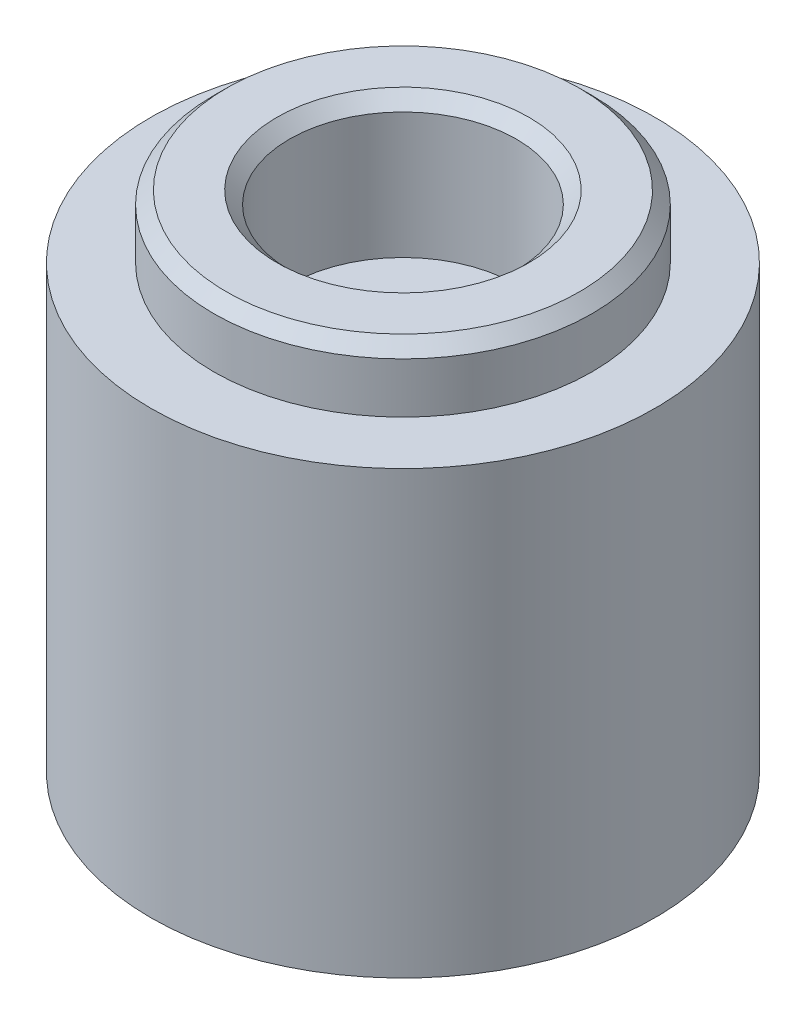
ISO-10303-21;
HEADER;
FILE_DESCRIPTION(('STEP AP214'),'2;1');
FILE_NAME('part.step','',(''),(''),'','','');
FILE_SCHEMA(('AUTOMOTIVE_DESIGN { 1 0 10303 214 1 1 1 1 }'));
ENDSEC;
DATA;
#1=APPLICATION_CONTEXT('core data for automotive mechanical design processes');
#2=APPLICATION_PROTOCOL_DEFINITION('international standard','automotive_design',2000,#1);
#3=PRODUCT_CONTEXT('',#1,'mechanical');
#4=PRODUCT('Part','Part','',(#3));
#5=PRODUCT_RELATED_PRODUCT_CATEGORY('part','',(#4));
#6=PRODUCT_DEFINITION_FORMATION('','',#4);
#7=PRODUCT_DEFINITION_CONTEXT('part definition',#1,'design');
#8=PRODUCT_DEFINITION('design','',#6,#7);
#9=PRODUCT_DEFINITION_SHAPE('','',#8);
#10=(LENGTH_UNIT() NAMED_UNIT(*) SI_UNIT(.MILLI.,.METRE.));
#11=(NAMED_UNIT(*) PLANE_ANGLE_UNIT() SI_UNIT($,.RADIAN.));
#12=(NAMED_UNIT(*) SI_UNIT($,.STERADIAN.) SOLID_ANGLE_UNIT());
#13=UNCERTAINTY_MEASURE_WITH_UNIT(LENGTH_MEASURE(1.E-05),#10,'distance_accuracy_value','');
#14=(GEOMETRIC_REPRESENTATION_CONTEXT(3) GLOBAL_UNCERTAINTY_ASSIGNED_CONTEXT((#13)) GLOBAL_UNIT_ASSIGNED_CONTEXT((#10,
#11,#12)) REPRESENTATION_CONTEXT('',''));
#15=CARTESIAN_POINT('',(0.,0.,0.));
#16=DIRECTION('',(0.,0.,1.));
#17=DIRECTION('',(1.,0.,0.));
#18=AXIS2_PLACEMENT_3D('',#15,#16,#17);
#19=CARTESIAN_POINT('',(9.,0.,0.));
#20=DIRECTION('',(0.,1.,0.));
#21=DIRECTION('',(0.,0.,1.));
#22=AXIS2_PLACEMENT_3D('',#19,#20,#21);
#23=PLANE('',#22);
#24=CARTESIAN_POINT('',(0.,0.,0.));
#25=DIRECTION('',(0.,1.,0.));
#26=DIRECTION('',(0.,0.,1.));
#27=AXIS2_PLACEMENT_3D('',#24,#25,#26);
#28=CIRCLE('',#27,6.50000000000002);
#29=CARTESIAN_POINT('',(0.,0.,6.50000000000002));
#30=VERTEX_POINT('',#29);
#31=EDGE_CURVE('E52',#30,#30,#28,.T.);
#32=ORIENTED_EDGE('',*,*,#31,.T.);
#33=EDGE_LOOP('',(#32));
#34=FACE_BOUND('',#33,.T.);
#35=CARTESIAN_POINT('',(0.,0.,0.));
#36=DIRECTION('',(0.,1.,0.));
#37=DIRECTION('',(0.,0.,1.));
#38=AXIS2_PLACEMENT_3D('',#35,#36,#37);
#39=CIRCLE('',#38,7.99999999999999);
#40=CARTESIAN_POINT('',(0.,0.,7.99999999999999));
#41=VERTEX_POINT('',#40);
#42=EDGE_CURVE('E55',#41,#41,#39,.F.);
#43=ORIENTED_EDGE('',*,*,#42,.T.);
#44=EDGE_LOOP('',(#43));
#45=FACE_BOUND('',#44,.T.);
#46=ADVANCED_FACE('F27',(#34,#45),#23,.F.);
#47=CARTESIAN_POINT('',(0.,30.,0.));
#48=DIRECTION('',(0.,1.,0.));
#49=DIRECTION('',(0.,0.,1.));
#50=AXIS2_PLACEMENT_3D('',#47,#48,#49);
#51=CYLINDRICAL_SURFACE('',#50,9.);
#52=CARTESIAN_POINT('',(0.,1.00000000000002,0.));
#53=DIRECTION('',(0.,1.,0.));
#54=DIRECTION('',(0.,0.,1.));
#55=AXIS2_PLACEMENT_3D('',#52,#53,#54);
#56=CIRCLE('',#55,9.);
#57=CARTESIAN_POINT('',(0.,1.00000000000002,9.));
#58=VERTEX_POINT('',#57);
#59=EDGE_CURVE('E46',#58,#58,#56,.T.);
#60=ORIENTED_EDGE('',*,*,#59,.T.);
#61=EDGE_LOOP('',(#60));
#62=FACE_BOUND('',#61,.T.);
#63=CARTESIAN_POINT('',(0.,6.,0.));
#64=DIRECTION('',(0.,1.,0.));
#65=DIRECTION('',(0.,0.,1.));
#66=AXIS2_PLACEMENT_3D('',#63,#64,#65);
#67=CIRCLE('',#66,9.);
#68=CARTESIAN_POINT('',(0.,6.,9.));
#69=VERTEX_POINT('',#68);
#70=EDGE_CURVE('E58',#69,#69,#67,.T.);
#71=ORIENTED_EDGE('',*,*,#70,.F.);
#72=EDGE_LOOP('',(#71));
#73=FACE_BOUND('',#72,.T.);
#74=ADVANCED_FACE('F96',(#62,#73),#51,.T.);
#75=CARTESIAN_POINT('',(20.,6.,0.));
#76=DIRECTION('',(0.,1.,0.));
#77=DIRECTION('',(0.,0.,1.));
#78=AXIS2_PLACEMENT_3D('',#75,#76,#77);
#79=PLANE('',#78);
#80=CARTESIAN_POINT('',(0.,6.,0.));
#81=DIRECTION('',(0.,1.,0.));
#82=DIRECTION('',(0.,0.,1.));
#83=AXIS2_PLACEMENT_3D('',#80,#81,#82);
#84=CIRCLE('',#83,20.);
#85=CARTESIAN_POINT('',(0.,6.,20.));
#86=VERTEX_POINT('',#85);
#87=EDGE_CURVE('E61',#86,#86,#84,.T.);
#88=ORIENTED_EDGE('',*,*,#87,.F.);
#89=EDGE_LOOP('',(#88));
#90=FACE_BOUND('',#89,.T.);
#91=ORIENTED_EDGE('',*,*,#70,.T.);
#92=EDGE_LOOP('',(#91));
#93=FACE_BOUND('',#92,.T.);
#94=ADVANCED_FACE('F101',(#90,#93),#79,.F.);
#95=CARTESIAN_POINT('',(0.,30.,0.));
#96=DIRECTION('',(0.,1.,0.));
#97=DIRECTION('',(0.,0.,1.));
#98=AXIS2_PLACEMENT_3D('',#95,#96,#97);
#99=CYLINDRICAL_SURFACE('',#98,20.);
#100=CARTESIAN_POINT('',(0.,41.,0.));
#101=DIRECTION('',(0.,1.,0.));
#102=DIRECTION('',(0.,0.,1.));
#103=AXIS2_PLACEMENT_3D('',#100,#101,#102);
#104=CIRCLE('',#103,20.);
#105=CARTESIAN_POINT('',(0.,41.,20.));
#106=VERTEX_POINT('',#105);
#107=EDGE_CURVE('E64',#106,#106,#104,.T.);
#108=ORIENTED_EDGE('',*,*,#107,.F.);
#109=EDGE_LOOP('',(#108));
#110=FACE_BOUND('',#109,.T.);
#111=ORIENTED_EDGE('',*,*,#87,.T.);
#112=EDGE_LOOP('',(#111));
#113=FACE_BOUND('',#112,.T.);
#114=ADVANCED_FACE('F118',(#110,#113),#99,.T.);
#115=CARTESIAN_POINT('',(15.,41.,0.));
#116=DIRECTION('',(0.,-1.,0.));
#117=DIRECTION('',(0.,0.,-1.));
#118=AXIS2_PLACEMENT_3D('',#115,#116,#117);
#119=PLANE('',#118);
#120=CARTESIAN_POINT('',(0.,41.,0.));
#121=DIRECTION('',(0.,1.,0.));
#122=DIRECTION('',(0.,0.,1.));
#123=AXIS2_PLACEMENT_3D('',#120,#121,#122);
#124=CIRCLE('',#123,15.);
#125=CARTESIAN_POINT('',(0.,41.,15.));
#126=VERTEX_POINT('',#125);
#127=EDGE_CURVE('E67',#126,#126,#124,.T.);
#128=ORIENTED_EDGE('',*,*,#127,.F.);
#129=EDGE_LOOP('',(#128));
#130=FACE_BOUND('',#129,.T.);
#131=ORIENTED_EDGE('',*,*,#107,.T.);
#132=EDGE_LOOP('',(#131));
#133=FACE_BOUND('',#132,.T.);
#134=ADVANCED_FACE('F124',(#130,#133),#119,.F.);
#135=CARTESIAN_POINT('',(0.,30.,0.));
#136=DIRECTION('',(0.,1.,0.));
#137=DIRECTION('',(0.,0.,1.));
#138=AXIS2_PLACEMENT_3D('',#135,#136,#137);
#139=CYLINDRICAL_SURFACE('',#138,15.);
#140=CARTESIAN_POINT('',(0.,45.,0.));
#141=DIRECTION('',(0.,-1.,0.));
#142=DIRECTION('',(0.,0.,-1.));
#143=AXIS2_PLACEMENT_3D('',#140,#141,#142);
#144=CIRCLE('',#143,15.);
#145=CARTESIAN_POINT('',(0.,45.,-15.));
#146=VERTEX_POINT('',#145);
#147=EDGE_CURVE('E10',#146,#146,#144,.T.);
#148=ORIENTED_EDGE('',*,*,#147,.T.);
#149=EDGE_LOOP('',(#148));
#150=FACE_BOUND('',#149,.T.);
#151=ORIENTED_EDGE('',*,*,#127,.T.);
#152=EDGE_LOOP('',(#151));
#153=FACE_BOUND('',#152,.T.);
#154=ADVANCED_FACE('F93',(#150,#153),#139,.T.);
#155=CARTESIAN_POINT('',(9.,46.,0.));
#156=DIRECTION('',(0.,-1.,0.));
#157=DIRECTION('',(0.,0.,-1.));
#158=AXIS2_PLACEMENT_3D('',#155,#156,#157);
#159=PLANE('',#158);
#160=CARTESIAN_POINT('',(0.,46.,0.));
#161=DIRECTION('',(0.,-1.,0.));
#162=DIRECTION('',(0.,0.,-1.));
#163=AXIS2_PLACEMENT_3D('',#160,#161,#162);
#164=CIRCLE('',#163,10.);
#165=CARTESIAN_POINT('',(0.,46.,-10.));
#166=VERTEX_POINT('',#165);
#167=EDGE_CURVE('E33',#166,#166,#164,.T.);
#168=ORIENTED_EDGE('',*,*,#167,.T.);
#169=EDGE_LOOP('',(#168));
#170=FACE_BOUND('',#169,.T.);
#171=CARTESIAN_POINT('',(0.,46.,0.));
#172=DIRECTION('',(0.,-1.,0.));
#173=DIRECTION('',(0.,0.,-1.));
#174=AXIS2_PLACEMENT_3D('',#171,#172,#173);
#175=CIRCLE('',#174,14.);
#176=CARTESIAN_POINT('',(0.,46.,-14.));
#177=VERTEX_POINT('',#176);
#178=EDGE_CURVE('E37',#177,#177,#175,.F.);
#179=ORIENTED_EDGE('',*,*,#178,.T.);
#180=EDGE_LOOP('',(#179));
#181=FACE_BOUND('',#180,.T.);
#182=ADVANCED_FACE('F87',(#170,#181),#159,.F.);
#183=CARTESIAN_POINT('',(0.,30.,0.));
#184=DIRECTION('',(0.,1.,0.));
#185=DIRECTION('',(0.,0.,1.));
#186=AXIS2_PLACEMENT_3D('',#183,#184,#185);
#187=CYLINDRICAL_SURFACE('',#186,9.);
#188=CARTESIAN_POINT('',(0.,45.,0.));
#189=DIRECTION('',(0.,-1.,0.));
#190=DIRECTION('',(0.,0.,-1.));
#191=AXIS2_PLACEMENT_3D('',#188,#189,#190);
#192=CIRCLE('',#191,9.);
#193=CARTESIAN_POINT('',(0.,45.,-9.));
#194=VERTEX_POINT('',#193);
#195=EDGE_CURVE('E41',#194,#194,#192,.F.);
#196=ORIENTED_EDGE('',*,*,#195,.T.);
#197=EDGE_LOOP('',(#196));
#198=FACE_BOUND('',#197,.T.);
#199=CARTESIAN_POINT('',(0.,35.,0.));
#200=DIRECTION('',(0.,1.,0.));
#201=DIRECTION('',(0.,0.,1.));
#202=AXIS2_PLACEMENT_3D('',#199,#200,#201);
#203=CIRCLE('',#202,9.);
#204=CARTESIAN_POINT('',(0.,35.,9.));
#205=VERTEX_POINT('',#204);
#206=EDGE_CURVE('E70',#205,#205,#203,.T.);
#207=ORIENTED_EDGE('',*,*,#206,.F.);
#208=EDGE_LOOP('',(#207));
#209=FACE_BOUND('',#208,.T.);
#210=ADVANCED_FACE('F82',(#198,#209),#187,.F.);
#211=CARTESIAN_POINT('',(9.,35.,0.));
#212=DIRECTION('',(0.,-1.,0.));
#213=DIRECTION('',(0.,0.,-1.));
#214=AXIS2_PLACEMENT_3D('',#211,#212,#213);
#215=PLANE('',#214);
#216=CARTESIAN_POINT('',(0.,35.,0.));
#217=DIRECTION('',(0.,1.,0.));
#218=DIRECTION('',(0.,0.,1.));
#219=AXIS2_PLACEMENT_3D('',#216,#217,#218);
#220=CIRCLE('',#219,5.5);
#221=CARTESIAN_POINT('',(0.,35.,5.5));
#222=VERTEX_POINT('',#221);
#223=EDGE_CURVE('E73',#222,#222,#220,.T.);
#224=ORIENTED_EDGE('',*,*,#223,.F.);
#225=EDGE_LOOP('',(#224));
#226=FACE_BOUND('',#225,.T.);
#227=ORIENTED_EDGE('',*,*,#206,.T.);
#228=EDGE_LOOP('',(#227));
#229=FACE_BOUND('',#228,.T.);
#230=ADVANCED_FACE('F79',(#226,#229),#215,.F.);
#231=CARTESIAN_POINT('',(0.,30.,0.));
#232=DIRECTION('',(0.,1.,0.));
#233=DIRECTION('',(0.,0.,1.));
#234=AXIS2_PLACEMENT_3D('',#231,#232,#233);
#235=CYLINDRICAL_SURFACE('',#234,5.5);
#236=CARTESIAN_POINT('',(0.,1.00000000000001,0.));
#237=DIRECTION('',(0.,1.,0.));
#238=DIRECTION('',(0.,0.,1.));
#239=AXIS2_PLACEMENT_3D('',#236,#237,#238);
#240=CIRCLE('',#239,5.5);
#241=CARTESIAN_POINT('',(0.,1.00000000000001,5.5));
#242=VERTEX_POINT('',#241);
#243=EDGE_CURVE('E49',#242,#242,#240,.F.);
#244=ORIENTED_EDGE('',*,*,#243,.T.);
#245=EDGE_LOOP('',(#244));
#246=FACE_BOUND('',#245,.T.);
#247=ORIENTED_EDGE('',*,*,#223,.T.);
#248=EDGE_LOOP('',(#247));
#249=FACE_BOUND('',#248,.T.);
#250=ADVANCED_FACE('F77',(#246,#249),#235,.F.);
#251=CARTESIAN_POINT('',(0.,0.,0.));
#252=DIRECTION('',(0.,-1.,0.));
#253=DIRECTION('',(0.,0.,-1.));
#254=AXIS2_PLACEMENT_3D('',#251,#252,#253);
#255=CONICAL_SURFACE('',#254,6.50000000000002,0.785398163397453);
#256=ORIENTED_EDGE('',*,*,#243,.F.);
#257=EDGE_LOOP('',(#256));
#258=FACE_BOUND('',#257,.T.);
#259=ORIENTED_EDGE('',*,*,#31,.F.);
#260=EDGE_LOOP('',(#259));
#261=FACE_BOUND('',#260,.T.);
#262=ADVANCED_FACE('F111',(#258,#261),#255,.F.);
#263=CARTESIAN_POINT('',(0.,1.00000000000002,0.));
#264=DIRECTION('',(0.,1.,0.));
#265=DIRECTION('',(0.,0.,1.));
#266=AXIS2_PLACEMENT_3D('',#263,#264,#265);
#267=CONICAL_SURFACE('',#266,9.,0.785398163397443);
#268=ORIENTED_EDGE('',*,*,#42,.F.);
#269=EDGE_LOOP('',(#268));
#270=FACE_BOUND('',#269,.T.);
#271=ORIENTED_EDGE('',*,*,#59,.F.);
#272=EDGE_LOOP('',(#271));
#273=FACE_BOUND('',#272,.T.);
#274=ADVANCED_FACE('F107',(#270,#273),#267,.T.);
#275=CARTESIAN_POINT('',(0.,45.,0.));
#276=DIRECTION('',(0.,1.,0.));
#277=DIRECTION('',(0.,0.,1.));
#278=AXIS2_PLACEMENT_3D('',#275,#276,#277);
#279=CONICAL_SURFACE('',#278,9.,0.785398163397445);
#280=ORIENTED_EDGE('',*,*,#167,.F.);
#281=EDGE_LOOP('',(#280));
#282=FACE_BOUND('',#281,.T.);
#283=ORIENTED_EDGE('',*,*,#195,.F.);
#284=EDGE_LOOP('',(#283));
#285=FACE_BOUND('',#284,.T.);
#286=ADVANCED_FACE('F110',(#282,#285),#279,.F.);
#287=CARTESIAN_POINT('',(0.,46.,0.));
#288=DIRECTION('',(0.,-1.,0.));
#289=DIRECTION('',(0.,0.,-1.));
#290=AXIS2_PLACEMENT_3D('',#287,#288,#289);
#291=CONICAL_SURFACE('',#290,14.,0.785398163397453);
#292=ORIENTED_EDGE('',*,*,#147,.F.);
#293=EDGE_LOOP('',(#292));
#294=FACE_BOUND('',#293,.T.);
#295=ORIENTED_EDGE('',*,*,#178,.F.);
#296=EDGE_LOOP('',(#295));
#297=FACE_BOUND('',#296,.T.);
#298=ADVANCED_FACE('F189',(#294,#297),#291,.T.);
#299=CLOSED_SHELL('',(#46,#74,#94,#114,#134,#154,#182,#210,#230,#250,#262,#274,#286,#298));
#300=MANIFOLD_SOLID_BREP('B2',#299);
#301=ADVANCED_BREP_SHAPE_REPRESENTATION('',(#18,#300),#14);
#302=SHAPE_DEFINITION_REPRESENTATION(#9,#301);
ENDSEC;
END-ISO-10303-21;
